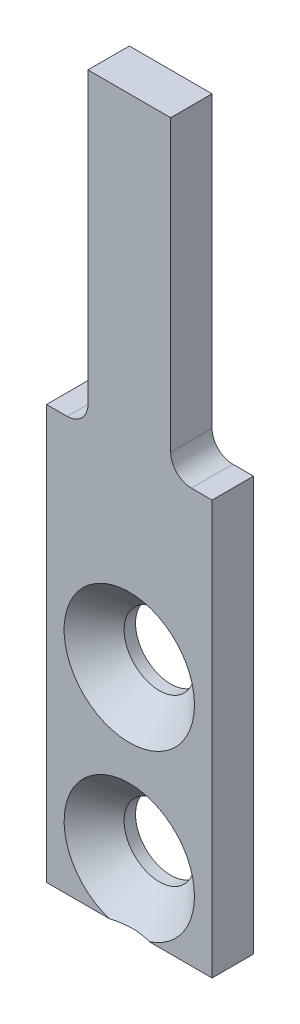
ISO-10303-21;
HEADER;
FILE_DESCRIPTION(('STEP AP214'),'2;1');
FILE_NAME('part.step','',(''),(''),'','','');
FILE_SCHEMA(('AUTOMOTIVE_DESIGN { 1 0 10303 214 1 1 1 1 }'));
ENDSEC;
DATA;
#1=APPLICATION_CONTEXT('core data for automotive mechanical design processes');
#2=APPLICATION_PROTOCOL_DEFINITION('international standard','automotive_design',2000,#1);
#3=PRODUCT_CONTEXT('',#1,'mechanical');
#4=PRODUCT('Part','Part','',(#3));
#5=PRODUCT_RELATED_PRODUCT_CATEGORY('part','',(#4));
#6=PRODUCT_DEFINITION_FORMATION('','',#4);
#7=PRODUCT_DEFINITION_CONTEXT('part definition',#1,'design');
#8=PRODUCT_DEFINITION('design','',#6,#7);
#9=PRODUCT_DEFINITION_SHAPE('','',#8);
#10=(LENGTH_UNIT() NAMED_UNIT(*) SI_UNIT(.MILLI.,.METRE.));
#11=(NAMED_UNIT(*) PLANE_ANGLE_UNIT() SI_UNIT($,.RADIAN.));
#12=(NAMED_UNIT(*) SI_UNIT($,.STERADIAN.) SOLID_ANGLE_UNIT());
#13=UNCERTAINTY_MEASURE_WITH_UNIT(LENGTH_MEASURE(1.E-05),#10,'distance_accuracy_value','');
#14=(GEOMETRIC_REPRESENTATION_CONTEXT(3) GLOBAL_UNCERTAINTY_ASSIGNED_CONTEXT((#13)) GLOBAL_UNIT_ASSIGNED_CONTEXT((#10,
#11,#12)) REPRESENTATION_CONTEXT('',''));
#15=CARTESIAN_POINT('',(0.,0.,0.));
#16=DIRECTION('',(0.,0.,1.));
#17=DIRECTION('',(1.,0.,0.));
#18=AXIS2_PLACEMENT_3D('',#15,#16,#17);
#19=CARTESIAN_POINT('',(4.,20.,2.));
#20=DIRECTION('',(-1.,0.,0.));
#21=DIRECTION('',(0.,-1.,0.));
#22=AXIS2_PLACEMENT_3D('',#19,#20,#21);
#23=PLANE('',#22);
#24=DIRECTION('',(0.,1.,0.));
#25=VECTOR('',#24,1.);
#26=CARTESIAN_POINT('',(4.,20.,0.));
#27=LINE('',#26,#25);
#28=CARTESIAN_POINT('',(4.,-20.,0.));
#29=VERTEX_POINT('',#28);
#30=CARTESIAN_POINT('',(4.,0.,0.));
#31=VERTEX_POINT('',#30);
#32=EDGE_CURVE('E243',#29,#31,#27,.T.);
#33=ORIENTED_EDGE('',*,*,#32,.T.);
#34=DIRECTION('',(0.,0.,1.));
#35=VECTOR('',#34,1.);
#36=CARTESIAN_POINT('',(4.,0.,0.));
#37=LINE('',#36,#35);
#38=CARTESIAN_POINT('',(4.,0.,2.));
#39=VERTEX_POINT('',#38);
#40=EDGE_CURVE('E126',#31,#39,#37,.T.);
#41=ORIENTED_EDGE('',*,*,#40,.T.);
#42=DIRECTION('',(0.,1.,0.));
#43=VECTOR('',#42,1.);
#44=CARTESIAN_POINT('',(4.,20.,2.));
#45=LINE('',#44,#43);
#46=CARTESIAN_POINT('',(4.,-20.,2.));
#47=VERTEX_POINT('',#46);
#48=EDGE_CURVE('E240',#47,#39,#45,.T.);
#49=ORIENTED_EDGE('',*,*,#48,.F.);
#50=DIRECTION('',(0.,0.,-1.));
#51=VECTOR('',#50,1.);
#52=CARTESIAN_POINT('',(4.,-20.,2.));
#53=LINE('',#52,#51);
#54=EDGE_CURVE('E232',#47,#29,#53,.T.);
#55=ORIENTED_EDGE('',*,*,#54,.T.);
#56=EDGE_LOOP('',(#33,#41,#49,#55));
#57=FACE_BOUND('',#56,.T.);
#58=ADVANCED_FACE('F16',(#57),#23,.F.);
#59=CARTESIAN_POINT('',(-4.,15.,2.));
#60=DIRECTION('',(0.,-1.,0.));
#61=DIRECTION('',(0.,0.,-1.));
#62=AXIS2_PLACEMENT_3D('',#59,#60,#61);
#63=PLANE('',#62);
#64=DIRECTION('',(-1.,0.,0.));
#65=VECTOR('',#64,1.);
#66=CARTESIAN_POINT('',(-4.,15.,2.));
#67=LINE('',#66,#65);
#68=CARTESIAN_POINT('',(2.,15.,2.));
#69=VERTEX_POINT('',#68);
#70=CARTESIAN_POINT('',(-2.,15.,2.));
#71=VERTEX_POINT('',#70);
#72=EDGE_CURVE('E252',#69,#71,#67,.T.);
#73=ORIENTED_EDGE('',*,*,#72,.F.);
#74=DIRECTION('',(0.,0.,1.));
#75=VECTOR('',#74,1.);
#76=CARTESIAN_POINT('',(2.,15.,0.));
#77=LINE('',#76,#75);
#78=CARTESIAN_POINT('',(2.,15.,0.));
#79=VERTEX_POINT('',#78);
#80=EDGE_CURVE('E20',#79,#69,#77,.T.);
#81=ORIENTED_EDGE('',*,*,#80,.F.);
#82=DIRECTION('',(-1.,0.,0.));
#83=VECTOR('',#82,1.);
#84=CARTESIAN_POINT('',(-4.,15.,0.));
#85=LINE('',#84,#83);
#86=CARTESIAN_POINT('',(-2.,15.,0.));
#87=VERTEX_POINT('',#86);
#88=EDGE_CURVE('E223',#79,#87,#85,.T.);
#89=ORIENTED_EDGE('',*,*,#88,.T.);
#90=DIRECTION('',(0.,0.,1.));
#91=VECTOR('',#90,1.);
#92=CARTESIAN_POINT('',(-2.,15.,2.));
#93=LINE('',#92,#91);
#94=EDGE_CURVE('E246',#87,#71,#93,.T.);
#95=ORIENTED_EDGE('',*,*,#94,.T.);
#96=EDGE_LOOP('',(#73,#81,#89,#95));
#97=FACE_BOUND('',#96,.T.);
#98=ADVANCED_FACE('F18',(#97),#63,.F.);
#99=CARTESIAN_POINT('',(-4.,20.,2.));
#100=DIRECTION('',(1.,0.,0.));
#101=DIRECTION('',(0.,1.,0.));
#102=AXIS2_PLACEMENT_3D('',#99,#100,#101);
#103=PLANE('',#102);
#104=DIRECTION('',(0.,-1.,0.));
#105=VECTOR('',#104,1.);
#106=CARTESIAN_POINT('',(-4.,20.,2.));
#107=LINE('',#106,#105);
#108=CARTESIAN_POINT('',(-4.,0.,2.));
#109=VERTEX_POINT('',#108);
#110=CARTESIAN_POINT('',(-4.,-20.,2.));
#111=VERTEX_POINT('',#110);
#112=EDGE_CURVE('E250',#109,#111,#107,.T.);
#113=ORIENTED_EDGE('',*,*,#112,.F.);
#114=DIRECTION('',(0.,0.,1.));
#115=VECTOR('',#114,1.);
#116=CARTESIAN_POINT('',(-4.,0.,0.));
#117=LINE('',#116,#115);
#118=CARTESIAN_POINT('',(-4.,0.,0.));
#119=VERTEX_POINT('',#118);
#120=EDGE_CURVE('E125',#119,#109,#117,.T.);
#121=ORIENTED_EDGE('',*,*,#120,.F.);
#122=DIRECTION('',(0.,-1.,0.));
#123=VECTOR('',#122,1.);
#124=CARTESIAN_POINT('',(-4.,20.,0.));
#125=LINE('',#124,#123);
#126=CARTESIAN_POINT('',(-4.,-20.,0.));
#127=VERTEX_POINT('',#126);
#128=EDGE_CURVE('E241',#119,#127,#125,.T.);
#129=ORIENTED_EDGE('',*,*,#128,.T.);
#130=DIRECTION('',(0.,0.,-1.));
#131=VECTOR('',#130,1.);
#132=CARTESIAN_POINT('',(-4.,-20.,2.));
#133=LINE('',#132,#131);
#134=EDGE_CURVE('E229',#111,#127,#133,.T.);
#135=ORIENTED_EDGE('',*,*,#134,.F.);
#136=EDGE_LOOP('',(#113,#121,#129,#135));
#137=FACE_BOUND('',#136,.T.);
#138=ADVANCED_FACE('F161',(#137),#103,.F.);
#139=CARTESIAN_POINT('',(-4.,-20.,2.));
#140=DIRECTION('',(0.,1.,0.));
#141=DIRECTION('',(0.,0.,1.));
#142=AXIS2_PLACEMENT_3D('',#139,#140,#141);
#143=PLANE('',#142);
#144=DIRECTION('',(1.,0.,0.));
#145=VECTOR('',#144,1.);
#146=CARTESIAN_POINT('',(-4.,-20.,2.));
#147=LINE('',#146,#145);
#148=CARTESIAN_POINT('',(0.96046863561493,-20.,2.));
#149=VERTEX_POINT('',#148);
#150=EDGE_CURVE('E249',#149,#47,#147,.T.);
#151=ORIENTED_EDGE('',*,*,#150,.F.);
#152=CARTESIAN_POINT('',(-9.37704223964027,-20.,8.6952486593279));
#153=CARTESIAN_POINT('',(-9.15561858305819,-20.,8.48437405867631));
#154=CARTESIAN_POINT('',(-8.93386578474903,-20.,8.27384335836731));
#155=CARTESIAN_POINT('',(-8.48949552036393,-20.,7.85367734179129));
#156=CARTESIAN_POINT('',(-8.2668780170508,-20.,7.64404206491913));
#157=CARTESIAN_POINT('',(-7.82003455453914,-20.,7.22537132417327));
#158=CARTESIAN_POINT('',(-7.59580596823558,-20.,7.01633866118));
#159=CARTESIAN_POINT('',(-7.14601184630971,-20.,6.59972845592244));
#160=CARTESIAN_POINT('',(-6.92044634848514,-20.,6.39215087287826));
#161=CARTESIAN_POINT('',(-6.44146495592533,-20.,5.95505197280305));
#162=CARTESIAN_POINT('',(-6.1878378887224,-20.,5.72576148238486));
#163=CARTESIAN_POINT('',(-5.67762132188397,-20.,5.27044558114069));
#164=CARTESIAN_POINT('',(-5.42103154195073,-20.,5.04442048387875));
#165=CARTESIAN_POINT('',(-4.90410147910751,-20.,4.59745425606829));
#166=CARTESIAN_POINT('',(-4.64376738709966,-20.,4.37650602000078));
#167=CARTESIAN_POINT('',(-4.24873855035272,-20.,4.05060765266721));
#168=CARTESIAN_POINT('',(-4.11631787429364,-20.,3.94290349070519));
#169=CARTESIAN_POINT('',(-3.84959838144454,-20.,3.72985048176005));
#170=CARTESIAN_POINT('',(-3.71529965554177,-20.,3.624501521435));
#171=CARTESIAN_POINT('',(-3.47662065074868,-20.,3.44156921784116));
#172=CARTESIAN_POINT('',(-3.37273047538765,-20.,3.36334733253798));
#173=CARTESIAN_POINT('',(-3.1633315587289,-20.,3.20908789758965));
#174=CARTESIAN_POINT('',(-3.05782276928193,-20.,3.13305041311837));
#175=CARTESIAN_POINT('',(-2.84465155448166,-20.,2.98355241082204));
#176=CARTESIAN_POINT('',(-2.7369850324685,-20.,2.91009770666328));
#177=CARTESIAN_POINT('',(-2.51935031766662,-20.,2.76668493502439));
#178=CARTESIAN_POINT('',(-2.40938224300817,-20.,2.69672668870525));
#179=CARTESIAN_POINT('',(-2.18928996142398,-20.,2.56288848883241));
#180=CARTESIAN_POINT('',(-2.07923012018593,-20.,2.49890434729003));
#181=CARTESIAN_POINT('',(-1.85607156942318,-20.,2.3765119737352));
#182=CARTESIAN_POINT('',(-1.74297200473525,-20.,2.31810533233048));
#183=CARTESIAN_POINT('',(-1.39916678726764,-20.,2.15411681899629));
#184=CARTESIAN_POINT('',(-1.16288730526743,-20.,2.05908052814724));
#185=CARTESIAN_POINT('',(-0.845224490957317,-20.,1.96598284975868));
#186=CARTESIAN_POINT('',(-0.770063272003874,-20.,1.94637750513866));
#187=CARTESIAN_POINT('',(-0.618570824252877,-20.,1.91221849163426));
#188=CARTESIAN_POINT('',(-0.542239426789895,-20.,1.89766555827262));
#189=CARTESIAN_POINT('',(-0.388890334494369,-20.,1.87415480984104));
#190=CARTESIAN_POINT('',(-0.31187460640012,-20.,1.86518428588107));
#191=CARTESIAN_POINT('',(-0.157383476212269,-20.,1.85313800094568));
#192=CARTESIAN_POINT('',(-0.0799080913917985,-20.,1.85006201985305));
#193=CARTESIAN_POINT('',(0.089553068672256,-20.,1.84992852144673));
#194=CARTESIAN_POINT('',(0.181542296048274,-20.,1.85410439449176));
#195=CARTESIAN_POINT('',(0.36476897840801,-20.,1.87071560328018));
#196=CARTESIAN_POINT('',(0.456006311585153,-20.,1.88315225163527));
#197=CARTESIAN_POINT('',(0.637468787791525,-20.,1.91567448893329));
#198=CARTESIAN_POINT('',(0.727688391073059,-20.,1.93579060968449));
#199=CARTESIAN_POINT('',(0.906337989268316,-20.,1.98273350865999));
#200=CARTESIAN_POINT('',(0.994767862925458,-20.,2.00956073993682));
#201=CARTESIAN_POINT('',(1.271596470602,-20.,2.10348442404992));
#202=CARTESIAN_POINT('',(1.45645458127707,-20.,2.18108705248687));
#203=CARTESIAN_POINT('',(1.72720338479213,-20.,2.3107748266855));
#204=CARTESIAN_POINT('',(1.81645762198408,-20.,2.35627532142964));
#205=CARTESIAN_POINT('',(1.99302102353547,-20.,2.45091312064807));
#206=CARTESIAN_POINT('',(2.08033049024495,-20.,2.50004985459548));
#207=CARTESIAN_POINT('',(2.25442893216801,-20.,2.60198623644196));
#208=CARTESIAN_POINT('',(2.34119308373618,-20.,2.65482785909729));
#209=CARTESIAN_POINT('',(2.51316015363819,-20.,2.76299212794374));
#210=CARTESIAN_POINT('',(2.59836303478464,-20.,2.81831483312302));
#211=CARTESIAN_POINT('',(2.7673250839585,-20.,2.93094656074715));
#212=CARTESIAN_POINT('',(2.85108553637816,-20.,2.9882536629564));
#213=CARTESIAN_POINT('',(3.01741558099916,-20.,3.10455905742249));
#214=CARTESIAN_POINT('',(3.09998522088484,-20.,3.1635572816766));
#215=CARTESIAN_POINT('',(3.37209852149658,-20.,3.36153651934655));
#216=CARTESIAN_POINT('',(3.55940777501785,-20.,3.50358924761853));
#217=CARTESIAN_POINT('',(3.93001997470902,-20.,3.79284384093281));
#218=CARTESIAN_POINT('',(4.11332219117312,-20.,3.94004663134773));
#219=CARTESIAN_POINT('',(4.47700360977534,-20.,4.23820214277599));
#220=CARTESIAN_POINT('',(4.65738123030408,-20.,4.38915678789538));
#221=CARTESIAN_POINT('',(5.01583610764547,-20.,4.69377489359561));
#222=CARTESIAN_POINT('',(5.19391329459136,-20.,4.84743843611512));
#223=CARTESIAN_POINT('',(5.54870435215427,-20.,5.15718808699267));
#224=CARTESIAN_POINT('',(5.72541388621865,-20.,5.31327915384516));
#225=CARTESIAN_POINT('',(6.07740885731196,-20.,5.6270616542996));
#226=CARTESIAN_POINT('',(6.25269427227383,-20.,5.78475311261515));
#227=CARTESIAN_POINT('',(6.77673380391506,-20.,6.25959719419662));
#228=CARTESIAN_POINT('',(7.12378932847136,-20.,6.57862351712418));
#229=CARTESIAN_POINT('',(7.77312377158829,-20.,7.18119390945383));
#230=CARTESIAN_POINT('',(8.07574697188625,-20.,7.46436850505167));
#231=CARTESIAN_POINT('',(8.67929374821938,-20.,8.03258037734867));
#232=CARTESIAN_POINT('',(8.9802171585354,-20.,8.317617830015));
#233=CARTESIAN_POINT('',(9.57942987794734,-20.,8.88777881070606));
#234=CARTESIAN_POINT('',(9.87772494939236,-20.,9.17289629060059));
#235=CARTESIAN_POINT('',(10.4732727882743,-20.,9.74415130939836));
#236=CARTESIAN_POINT('',(10.7705256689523,-20.,10.0302887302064));
#237=CARTESIAN_POINT('',(11.0674117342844,-20.,10.3168043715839));
#238=B_SPLINE_CURVE_WITH_KNOTS('',3,(#152,#153,#154,#155,#156,#157,#158,#159,#160,#161,#162,
#163,#164,#165,#166,#167,#168,#169,#170,#171,#172,#173,#174,#175,#176,#177,#178,#179,#180,#181,
#182,#183,#184,#185,#186,#187,#188,#189,#190,#191,#192,#193,#194,#195,#196,#197,#198,#199,#200,
#201,#202,#203,#204,#205,#206,#207,#208,#209,#210,#211,#212,#213,#214,#215,#216,#217,#218,#219,
#220,#221,#222,#223,#224,#225,#226,#227,#228,#229,#230,#231,#232,#233,#234,#235,#236,#237),
.UNSPECIFIED.,.F.,.F.,(4,2,2,2,2,2,2,2,2,2,2,2,2,2,2,2,2,2,2,2,2,2,2,2,2,2,2,2,2,2,2,2,2,2,2,2,
2,2,2,2,2,2,4),(0.,0.91731745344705,1.83467485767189,2.75432071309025,3.67394069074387,
4.69964192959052,5.72544101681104,6.74970416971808,7.26175804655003,7.77378722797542,
8.16390113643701,8.5540266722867,8.94498045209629,9.33591421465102,9.71766347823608,
10.0995212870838,10.8594445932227,11.0923355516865,11.3252603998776,11.5576530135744,
11.7900369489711,12.0658887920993,12.341784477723,12.6187886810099,12.8958115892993,
13.495527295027,13.796045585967,14.0965168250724,14.4012374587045,14.7059653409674,
15.0104061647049,15.3148347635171,16.0199286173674,16.725149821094,17.4307404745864,
18.1363525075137,18.8436703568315,19.5509991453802,20.9651846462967,22.2085265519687,
23.4519876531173,24.6899055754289,25.9276845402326),.UNSPECIFIED.);
#239=CARTESIAN_POINT('',(-0.96046863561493,-20.,2.));
#240=VERTEX_POINT('',#239);
#241=EDGE_CURVE('E11',#149,#240,#238,.F.);
#242=ORIENTED_EDGE('',*,*,#241,.T.);
#243=EDGE_CURVE('E237',#111,#240,#147,.T.);
#244=ORIENTED_EDGE('',*,*,#243,.F.);
#245=ORIENTED_EDGE('',*,*,#134,.T.);
#246=DIRECTION('',(1.,0.,0.));
#247=VECTOR('',#246,1.);
#248=CARTESIAN_POINT('',(-4.,-20.,0.));
#249=LINE('',#248,#247);
#250=EDGE_CURVE('E238',#127,#29,#249,.T.);
#251=ORIENTED_EDGE('',*,*,#250,.T.);
#252=ORIENTED_EDGE('',*,*,#54,.F.);
#253=EDGE_LOOP('',(#151,#242,#244,#245,#251,#252));
#254=FACE_BOUND('',#253,.T.);
#255=ADVANCED_FACE('F156',(#254),#143,.F.);
#256=CARTESIAN_POINT('',(0.,0.,2.));
#257=DIRECTION('',(0.,0.,1.));
#258=DIRECTION('',(1.,0.,0.));
#259=AXIS2_PLACEMENT_3D('',#256,#257,#258);
#260=PLANE('',#259);
#261=CARTESIAN_POINT('',(0.,-17.,2.));
#262=DIRECTION('',(0.,0.,1.));
#263=DIRECTION('',(1.,0.,0.));
#264=AXIS2_PLACEMENT_3D('',#261,#262,#263);
#265=CIRCLE('',#264,3.15);
#266=EDGE_CURVE('E34',#149,#240,#265,.T.);
#267=ORIENTED_EDGE('',*,*,#266,.F.);
#268=ORIENTED_EDGE('',*,*,#150,.T.);
#269=ORIENTED_EDGE('',*,*,#48,.T.);
#270=DIRECTION('',(1.,0.,0.));
#271=VECTOR('',#270,1.);
#272=CARTESIAN_POINT('',(4.,0.,2.));
#273=LINE('',#272,#271);
#274=CARTESIAN_POINT('',(3.,0.,2.));
#275=VERTEX_POINT('',#274);
#276=EDGE_CURVE('E66',#275,#39,#273,.T.);
#277=ORIENTED_EDGE('',*,*,#276,.F.);
#278=CARTESIAN_POINT('',(3.,1.,2.));
#279=DIRECTION('',(0.,0.,1.));
#280=DIRECTION('',(1.,0.,0.));
#281=AXIS2_PLACEMENT_3D('',#278,#279,#280);
#282=CIRCLE('',#281,1.);
#283=CARTESIAN_POINT('',(2.,1.,2.));
#284=VERTEX_POINT('',#283);
#285=EDGE_CURVE('E130',#275,#284,#282,.F.);
#286=ORIENTED_EDGE('',*,*,#285,.T.);
#287=DIRECTION('',(0.,-1.,0.));
#288=VECTOR('',#287,1.);
#289=CARTESIAN_POINT('',(2.,20.,2.));
#290=LINE('',#289,#288);
#291=EDGE_CURVE('E142',#69,#284,#290,.T.);
#292=ORIENTED_EDGE('',*,*,#291,.F.);
#293=ORIENTED_EDGE('',*,*,#72,.T.);
#294=DIRECTION('',(0.,1.,0.));
#295=VECTOR('',#294,1.);
#296=CARTESIAN_POINT('',(-2.,20.,2.));
#297=LINE('',#296,#295);
#298=CARTESIAN_POINT('',(-2.,1.,2.));
#299=VERTEX_POINT('',#298);
#300=EDGE_CURVE('E113',#299,#71,#297,.T.);
#301=ORIENTED_EDGE('',*,*,#300,.F.);
#302=CARTESIAN_POINT('',(-3.,1.,2.));
#303=DIRECTION('',(0.,0.,1.));
#304=DIRECTION('',(1.,0.,0.));
#305=AXIS2_PLACEMENT_3D('',#302,#303,#304);
#306=CIRCLE('',#305,1.);
#307=CARTESIAN_POINT('',(-3.,0.,2.));
#308=VERTEX_POINT('',#307);
#309=EDGE_CURVE('E106',#299,#308,#306,.F.);
#310=ORIENTED_EDGE('',*,*,#309,.T.);
#311=DIRECTION('',(1.,0.,0.));
#312=VECTOR('',#311,1.);
#313=CARTESIAN_POINT('',(-4.,0.,2.));
#314=LINE('',#313,#312);
#315=EDGE_CURVE('E110',#109,#308,#314,.T.);
#316=ORIENTED_EDGE('',*,*,#315,.F.);
#317=ORIENTED_EDGE('',*,*,#112,.T.);
#318=ORIENTED_EDGE('',*,*,#243,.T.);
#319=EDGE_LOOP('',(#267,#268,#269,#277,#286,#292,#293,#301,#310,#316,#317,#318));
#320=FACE_BOUND('',#319,.T.);
#321=CARTESIAN_POINT('',(0.,-9.,2.));
#322=DIRECTION('',(0.,0.,1.));
#323=DIRECTION('',(1.,0.,0.));
#324=AXIS2_PLACEMENT_3D('',#321,#322,#323);
#325=CIRCLE('',#324,3.15);
#326=CARTESIAN_POINT('',(3.15,-9.,2.));
#327=VERTEX_POINT('',#326);
#328=EDGE_CURVE('E267',#327,#327,#325,.T.);
#329=ORIENTED_EDGE('',*,*,#328,.F.);
#330=EDGE_LOOP('',(#329));
#331=FACE_BOUND('',#330,.T.);
#332=ADVANCED_FACE('F108',(#320,#331),#260,.T.);
#333=CARTESIAN_POINT('',(0.,0.,0.));
#334=DIRECTION('',(0.,0.,1.));
#335=DIRECTION('',(1.,0.,0.));
#336=AXIS2_PLACEMENT_3D('',#333,#334,#335);
#337=PLANE('',#336);
#338=CARTESIAN_POINT('',(0.,-17.,0.));
#339=DIRECTION('',(0.,0.,1.));
#340=DIRECTION('',(1.,0.,0.));
#341=AXIS2_PLACEMENT_3D('',#338,#339,#340);
#342=CIRCLE('',#341,1.7);
#343=CARTESIAN_POINT('',(1.7,-17.,0.));
#344=VERTEX_POINT('',#343);
#345=EDGE_CURVE('E151',#344,#344,#342,.T.);
#346=ORIENTED_EDGE('',*,*,#345,.T.);
#347=EDGE_LOOP('',(#346));
#348=FACE_BOUND('',#347,.T.);
#349=CARTESIAN_POINT('',(0.,-9.,0.));
#350=DIRECTION('',(0.,0.,1.));
#351=DIRECTION('',(1.,0.,0.));
#352=AXIS2_PLACEMENT_3D('',#349,#350,#351);
#353=CIRCLE('',#352,1.7);
#354=CARTESIAN_POINT('',(1.7,-9.,0.));
#355=VERTEX_POINT('',#354);
#356=EDGE_CURVE('E140',#355,#355,#353,.T.);
#357=ORIENTED_EDGE('',*,*,#356,.T.);
#358=EDGE_LOOP('',(#357));
#359=FACE_BOUND('',#358,.T.);
#360=DIRECTION('',(0.,-1.,0.));
#361=VECTOR('',#360,1.);
#362=CARTESIAN_POINT('',(2.,20.,0.));
#363=LINE('',#362,#361);
#364=CARTESIAN_POINT('',(2.,1.,0.));
#365=VERTEX_POINT('',#364);
#366=EDGE_CURVE('E56',#79,#365,#363,.T.);
#367=ORIENTED_EDGE('',*,*,#366,.T.);
#368=CARTESIAN_POINT('',(3.,1.,0.));
#369=DIRECTION('',(0.,0.,1.));
#370=DIRECTION('',(1.,0.,0.));
#371=AXIS2_PLACEMENT_3D('',#368,#369,#370);
#372=CIRCLE('',#371,1.);
#373=CARTESIAN_POINT('',(3.,0.,0.));
#374=VERTEX_POINT('',#373);
#375=EDGE_CURVE('E118',#365,#374,#372,.T.);
#376=ORIENTED_EDGE('',*,*,#375,.T.);
#377=DIRECTION('',(1.,0.,0.));
#378=VECTOR('',#377,1.);
#379=CARTESIAN_POINT('',(4.,0.,0.));
#380=LINE('',#379,#378);
#381=EDGE_CURVE('E224',#374,#31,#380,.T.);
#382=ORIENTED_EDGE('',*,*,#381,.T.);
#383=ORIENTED_EDGE('',*,*,#32,.F.);
#384=ORIENTED_EDGE('',*,*,#250,.F.);
#385=ORIENTED_EDGE('',*,*,#128,.F.);
#386=DIRECTION('',(1.,0.,0.));
#387=VECTOR('',#386,1.);
#388=CARTESIAN_POINT('',(-4.,0.,0.));
#389=LINE('',#388,#387);
#390=CARTESIAN_POINT('',(-3.,0.,0.));
#391=VERTEX_POINT('',#390);
#392=EDGE_CURVE('E257',#119,#391,#389,.T.);
#393=ORIENTED_EDGE('',*,*,#392,.T.);
#394=CARTESIAN_POINT('',(-3.,1.,0.));
#395=DIRECTION('',(0.,0.,1.));
#396=DIRECTION('',(1.,0.,0.));
#397=AXIS2_PLACEMENT_3D('',#394,#395,#396);
#398=CIRCLE('',#397,1.);
#399=CARTESIAN_POINT('',(-2.,1.,0.));
#400=VERTEX_POINT('',#399);
#401=EDGE_CURVE('E26',#391,#400,#398,.T.);
#402=ORIENTED_EDGE('',*,*,#401,.T.);
#403=DIRECTION('',(0.,1.,0.));
#404=VECTOR('',#403,1.);
#405=CARTESIAN_POINT('',(-2.,20.,0.));
#406=LINE('',#405,#404);
#407=EDGE_CURVE('E256',#400,#87,#406,.T.);
#408=ORIENTED_EDGE('',*,*,#407,.T.);
#409=ORIENTED_EDGE('',*,*,#88,.F.);
#410=EDGE_LOOP('',(#367,#376,#382,#383,#384,#385,#393,#402,#408,#409));
#411=FACE_BOUND('',#410,.T.);
#412=ADVANCED_FACE('F163',(#348,#359,#411),#337,.F.);
#413=CARTESIAN_POINT('',(-2.,20.,0.));
#414=DIRECTION('',(1.,0.,0.));
#415=DIRECTION('',(0.,1.,0.));
#416=AXIS2_PLACEMENT_3D('',#413,#414,#415);
#417=PLANE('',#416);
#418=ORIENTED_EDGE('',*,*,#407,.F.);
#419=DIRECTION('',(0.,0.,1.));
#420=VECTOR('',#419,1.);
#421=CARTESIAN_POINT('',(-2.,1.,2.));
#422=LINE('',#421,#420);
#423=EDGE_CURVE('E131',#400,#299,#422,.T.);
#424=ORIENTED_EDGE('',*,*,#423,.T.);
#425=ORIENTED_EDGE('',*,*,#300,.T.);
#426=ORIENTED_EDGE('',*,*,#94,.F.);
#427=EDGE_LOOP('',(#418,#424,#425,#426));
#428=FACE_BOUND('',#427,.T.);
#429=ADVANCED_FACE('F200',(#428),#417,.F.);
#430=CARTESIAN_POINT('',(-4.,0.,0.));
#431=DIRECTION('',(0.,-1.,0.));
#432=DIRECTION('',(1.,0.,0.));
#433=AXIS2_PLACEMENT_3D('',#430,#431,#432);
#434=PLANE('',#433);
#435=ORIENTED_EDGE('',*,*,#315,.T.);
#436=DIRECTION('',(0.,0.,1.));
#437=VECTOR('',#436,1.);
#438=CARTESIAN_POINT('',(-3.,0.,0.));
#439=LINE('',#438,#437);
#440=EDGE_CURVE('E122',#308,#391,#439,.F.);
#441=ORIENTED_EDGE('',*,*,#440,.T.);
#442=ORIENTED_EDGE('',*,*,#392,.F.);
#443=ORIENTED_EDGE('',*,*,#120,.T.);
#444=EDGE_LOOP('',(#435,#441,#442,#443));
#445=FACE_BOUND('',#444,.T.);
#446=ADVANCED_FACE('F121',(#445),#434,.F.);
#447=CARTESIAN_POINT('',(4.,0.,0.));
#448=DIRECTION('',(0.,-1.,0.));
#449=DIRECTION('',(1.,0.,0.));
#450=AXIS2_PLACEMENT_3D('',#447,#448,#449);
#451=PLANE('',#450);
#452=ORIENTED_EDGE('',*,*,#381,.F.);
#453=DIRECTION('',(0.,0.,1.));
#454=VECTOR('',#453,1.);
#455=CARTESIAN_POINT('',(3.,0.,2.));
#456=LINE('',#455,#454);
#457=EDGE_CURVE('E228',#374,#275,#456,.T.);
#458=ORIENTED_EDGE('',*,*,#457,.T.);
#459=ORIENTED_EDGE('',*,*,#276,.T.);
#460=ORIENTED_EDGE('',*,*,#40,.F.);
#461=EDGE_LOOP('',(#452,#458,#459,#460));
#462=FACE_BOUND('',#461,.T.);
#463=ADVANCED_FACE('F195',(#462),#451,.F.);
#464=CARTESIAN_POINT('',(2.,20.,0.));
#465=DIRECTION('',(-1.,0.,0.));
#466=DIRECTION('',(0.,-1.,0.));
#467=AXIS2_PLACEMENT_3D('',#464,#465,#466);
#468=PLANE('',#467);
#469=ORIENTED_EDGE('',*,*,#291,.T.);
#470=DIRECTION('',(0.,0.,1.));
#471=VECTOR('',#470,1.);
#472=CARTESIAN_POINT('',(2.,1.,0.));
#473=LINE('',#472,#471);
#474=EDGE_CURVE('E134',#284,#365,#473,.F.);
#475=ORIENTED_EDGE('',*,*,#474,.T.);
#476=ORIENTED_EDGE('',*,*,#366,.F.);
#477=ORIENTED_EDGE('',*,*,#80,.T.);
#478=EDGE_LOOP('',(#469,#475,#476,#477));
#479=FACE_BOUND('',#478,.T.);
#480=ADVANCED_FACE('F173',(#479),#468,.F.);
#481=CARTESIAN_POINT('',(3.,1.,0.));
#482=DIRECTION('',(0.,0.,-1.));
#483=DIRECTION('',(-1.,0.,0.));
#484=AXIS2_PLACEMENT_3D('',#481,#482,#483);
#485=CYLINDRICAL_SURFACE('',#484,1.);
#486=ORIENTED_EDGE('',*,*,#375,.F.);
#487=ORIENTED_EDGE('',*,*,#474,.F.);
#488=ORIENTED_EDGE('',*,*,#285,.F.);
#489=ORIENTED_EDGE('',*,*,#457,.F.);
#490=EDGE_LOOP('',(#486,#487,#488,#489));
#491=FACE_BOUND('',#490,.T.);
#492=ADVANCED_FACE('F171',(#491),#485,.F.);
#493=CARTESIAN_POINT('',(-3.,1.,0.));
#494=DIRECTION('',(0.,0.,-1.));
#495=DIRECTION('',(-1.,0.,0.));
#496=AXIS2_PLACEMENT_3D('',#493,#494,#495);
#497=CYLINDRICAL_SURFACE('',#496,1.);
#498=ORIENTED_EDGE('',*,*,#401,.F.);
#499=ORIENTED_EDGE('',*,*,#440,.F.);
#500=ORIENTED_EDGE('',*,*,#309,.F.);
#501=ORIENTED_EDGE('',*,*,#423,.F.);
#502=EDGE_LOOP('',(#498,#499,#500,#501));
#503=FACE_BOUND('',#502,.T.);
#504=ADVANCED_FACE('F129',(#503),#497,.F.);
#505=CARTESIAN_POINT('',(0.,-9.,2.));
#506=DIRECTION('',(0.,0.,1.));
#507=DIRECTION('',(1.,0.,0.));
#508=AXIS2_PLACEMENT_3D('',#505,#506,#507);
#509=CYLINDRICAL_SURFACE('',#508,1.7);
#510=CARTESIAN_POINT('',(0.,-9.,0.55));
#511=DIRECTION('',(0.,0.,1.));
#512=DIRECTION('',(1.,0.,0.));
#513=AXIS2_PLACEMENT_3D('',#510,#511,#512);
#514=CIRCLE('',#513,1.7);
#515=CARTESIAN_POINT('',(1.7,-9.,0.55));
#516=VERTEX_POINT('',#515);
#517=EDGE_CURVE('E143',#516,#516,#514,.T.);
#518=ORIENTED_EDGE('',*,*,#517,.T.);
#519=EDGE_LOOP('',(#518));
#520=FACE_BOUND('',#519,.T.);
#521=ORIENTED_EDGE('',*,*,#356,.F.);
#522=EDGE_LOOP('',(#521));
#523=FACE_BOUND('',#522,.T.);
#524=ADVANCED_FACE('F176',(#520,#523),#509,.F.);
#525=CARTESIAN_POINT('',(0.,-9.,2.));
#526=DIRECTION('',(0.,0.,1.));
#527=DIRECTION('',(1.,0.,0.));
#528=AXIS2_PLACEMENT_3D('',#525,#526,#527);
#529=CONICAL_SURFACE('',#528,3.15,0.785398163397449);
#530=ORIENTED_EDGE('',*,*,#517,.F.);
#531=EDGE_LOOP('',(#530));
#532=FACE_BOUND('',#531,.T.);
#533=ORIENTED_EDGE('',*,*,#328,.T.);
#534=EDGE_LOOP('',(#533));
#535=FACE_BOUND('',#534,.T.);
#536=ADVANCED_FACE('F182',(#532,#535),#529,.F.);
#537=CARTESIAN_POINT('',(0.,-17.,2.));
#538=DIRECTION('',(0.,0.,1.));
#539=DIRECTION('',(1.,0.,0.));
#540=AXIS2_PLACEMENT_3D('',#537,#538,#539);
#541=CYLINDRICAL_SURFACE('',#540,1.7);
#542=CARTESIAN_POINT('',(0.,-17.,0.55));
#543=DIRECTION('',(0.,0.,1.));
#544=DIRECTION('',(1.,0.,0.));
#545=AXIS2_PLACEMENT_3D('',#542,#543,#544);
#546=CIRCLE('',#545,1.7);
#547=CARTESIAN_POINT('',(1.7,-17.,0.55));
#548=VERTEX_POINT('',#547);
#549=EDGE_CURVE('E270',#548,#548,#546,.T.);
#550=ORIENTED_EDGE('',*,*,#549,.T.);
#551=EDGE_LOOP('',(#550));
#552=FACE_BOUND('',#551,.T.);
#553=ORIENTED_EDGE('',*,*,#345,.F.);
#554=EDGE_LOOP('',(#553));
#555=FACE_BOUND('',#554,.T.);
#556=ADVANCED_FACE('F189',(#552,#555),#541,.F.);
#557=CARTESIAN_POINT('',(0.,-17.,2.));
#558=DIRECTION('',(0.,0.,1.));
#559=DIRECTION('',(1.,0.,0.));
#560=AXIS2_PLACEMENT_3D('',#557,#558,#559);
#561=CONICAL_SURFACE('',#560,3.15,0.785398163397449);
#562=ORIENTED_EDGE('',*,*,#549,.F.);
#563=EDGE_LOOP('',(#562));
#564=FACE_BOUND('',#563,.T.);
#565=ORIENTED_EDGE('',*,*,#266,.T.);
#566=ORIENTED_EDGE('',*,*,#241,.F.);
#567=EDGE_LOOP('',(#565,#566));
#568=FACE_BOUND('',#567,.T.);
#569=ADVANCED_FACE('F153',(#564,#568),#561,.F.);
#570=CLOSED_SHELL('',(#58,#98,#138,#255,#332,#412,#429,#446,#463,#480,#492,#504,#524,#536,#556,#569));
#571=MANIFOLD_SOLID_BREP('B1',#570);
#572=ADVANCED_BREP_SHAPE_REPRESENTATION('',(#18,#571),#14);
#573=SHAPE_DEFINITION_REPRESENTATION(#9,#572);
ENDSEC;
END-ISO-10303-21;
